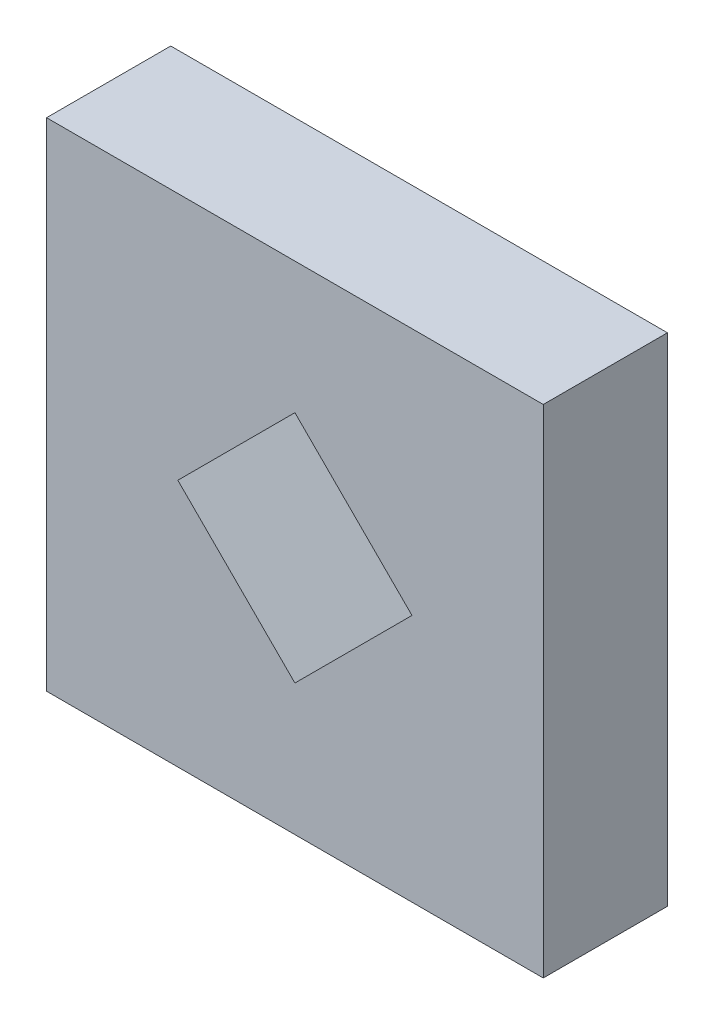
from build123d import *

# Parameters (mm, degrees)
SKETCH1_W           = 76.2
SKETCH1_H           = 76.2
BOSS_EXTRUDE1_DEPTH = 9.525
CUT_EXTRUDE1_DEPTH  = 19.05


with BuildPart() as part:
    # Sketch1 → Boss-Extrude1 (new, symmetric)
    with BuildSketch(Plane.XY):
        Rectangle(SKETCH1_W, SKETCH1_H)
    extrude(amount=BOSS_EXTRUDE1_DEPTH, both=True)

    # Sketch3 → Cut-Extrude1 (cut)
    with BuildSketch(Plane.XY.offset(9.525)):
        Polygon((-17.960512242, 0), (0, 17.960512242), (17.960512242, 0), (0, -17.960512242), align=None)
    extrude(amount=-CUT_EXTRUDE1_DEPTH, mode=Mode.SUBTRACT)


solid = part.part
